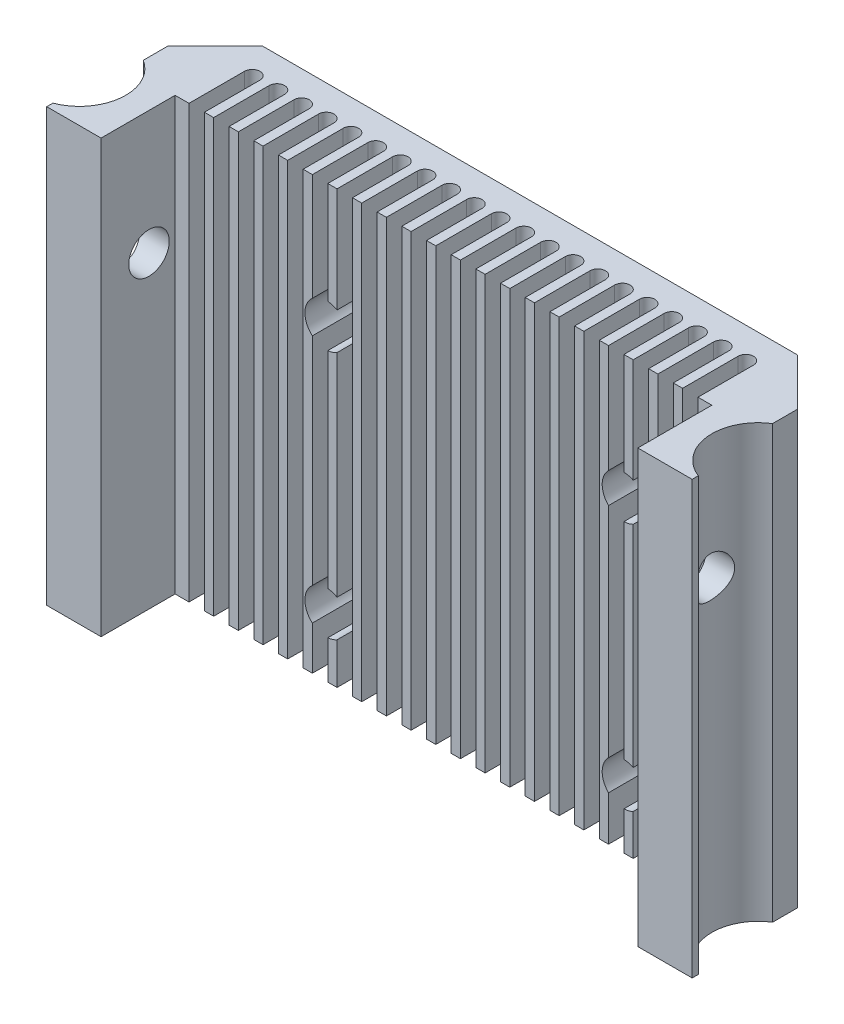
from build123d import *

# Parameters (mm, degrees)
BOSS_EXTRUDE1_DEPTH            = 44.45
CUT_EXTRUDE1_DEPTH             = 57.654193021
LPATTERN1_COUNT                = 11
LPATTERN1_PITCH                = 2.54
LPATTERN1_COL_COUNT            = 11
LPATTERN1_COL_PITCH            = 2.54
CBORE_FOR_M2_SHCS1_D           = 2.6
CBORE_FOR_M2_SHCS1_CBORE_D     = 4.4
CBORE_FOR_M2_SHCS1_CBORE_DEPTH = 7.842
F_8_32_TAPPED_HOLE3_D          = 4.1656


with BuildPart() as part:
    # Sketch1 → Boss-Extrude1 (new body)
    with BuildSketch(Plane(origin=(0, 0, 0), x_dir=(1, 0, 0), z_dir=(0, 1, 0))):
        with BuildLine():
            Line((-27.523623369, 11.43), (27.523623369, 11.43))
            Line((27.523623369, 11.43), (32.385, 6.568623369))
            Line((32.385, 6.568623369), (32.385, 4.028623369))
            ThreePointArc((32.385, 4.028623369), (30.185194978, -0.46438627), (33.215210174, -4.445))
            Line((33.215210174, -4.445), (33.215210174, -5.08))
            Line((33.215210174, -5.08), (27.6225, -5.08))
            Line((27.6225, -5.08), (27.6225, 2.54))
            Line((27.6225, 2.54), (-27.6225, 2.54))
            Line((-27.6225, 2.54), (-27.6225, -5.08))
            Line((-27.6225, -5.08), (-33.215210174, -5.08))
            Line((-33.215210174, -5.08), (-33.215210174, -4.445))
            ThreePointArc((-33.215210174, -4.445), (-30.185194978, -0.46438627), (-32.385, 4.028623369))
            Line((-32.385, 4.028623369), (-32.385, 6.568623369))
            Line((-32.385, 6.568623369), (-27.523623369, 11.43))
        make_face()
    extrude(amount=BOSS_EXTRUDE1_DEPTH)

    # Sketch12 → Cut-Extrude1 (cut, through all)
    with BuildSketch(Plane(origin=(0, 0, 0), x_dir=(1, 0, 0), z_dir=(0, 1, 0))):
        with BuildLine():
            Line((-0.79375, 2.54), (-0.79375, 8.255))
            ThreePointArc((-0.79375, 8.255), (0, 9.04875), (0.79375, 8.255))
            Line((0.79375, 8.255), (0.79375, 2.54))
            Line((0.79375, 2.54), (-0.79375, 2.54))
        make_face()
    cut_extrude1 = extrude(amount=CUT_EXTRUDE1_DEPTH, mode=Mode.SUBTRACT)

    # LPattern1: Cut-Extrude1 ×11
    with Locations(*[(i * LPATTERN1_PITCH, 0, 0) for i in range(1, LPATTERN1_COUNT)]):
        add(cut_extrude1, mode=Mode.SUBTRACT)

    # LPattern1 col: Cut-Extrude1 ×11
    with Locations(*[(-i * LPATTERN1_COL_PITCH, 0, 0) for i in range(1, LPATTERN1_COL_COUNT)]):
        add(cut_extrude1, mode=Mode.SUBTRACT)

    # CBORE for M2 SHCS1 (through all)
    with Locations(Plane.XY.offset(-2.54)):
        with Locations((-12.065, 31.75), (18.535, 31.75), (18.535, 6.15), (-12.065, 6.15)):
            CounterBoreHole(CBORE_FOR_M2_SHCS1_D / 2, CBORE_FOR_M2_SHCS1_CBORE_D / 2, CBORE_FOR_M2_SHCS1_CBORE_DEPTH)

    # 8-32 Tapped Hole3 (through all)
    with Locations(Plane.ZY.offset(32.385)):
        with Locations((0.14870594, 31.75)):
            Hole(F_8_32_TAPPED_HOLE3_D / 2)


solid = part.part
